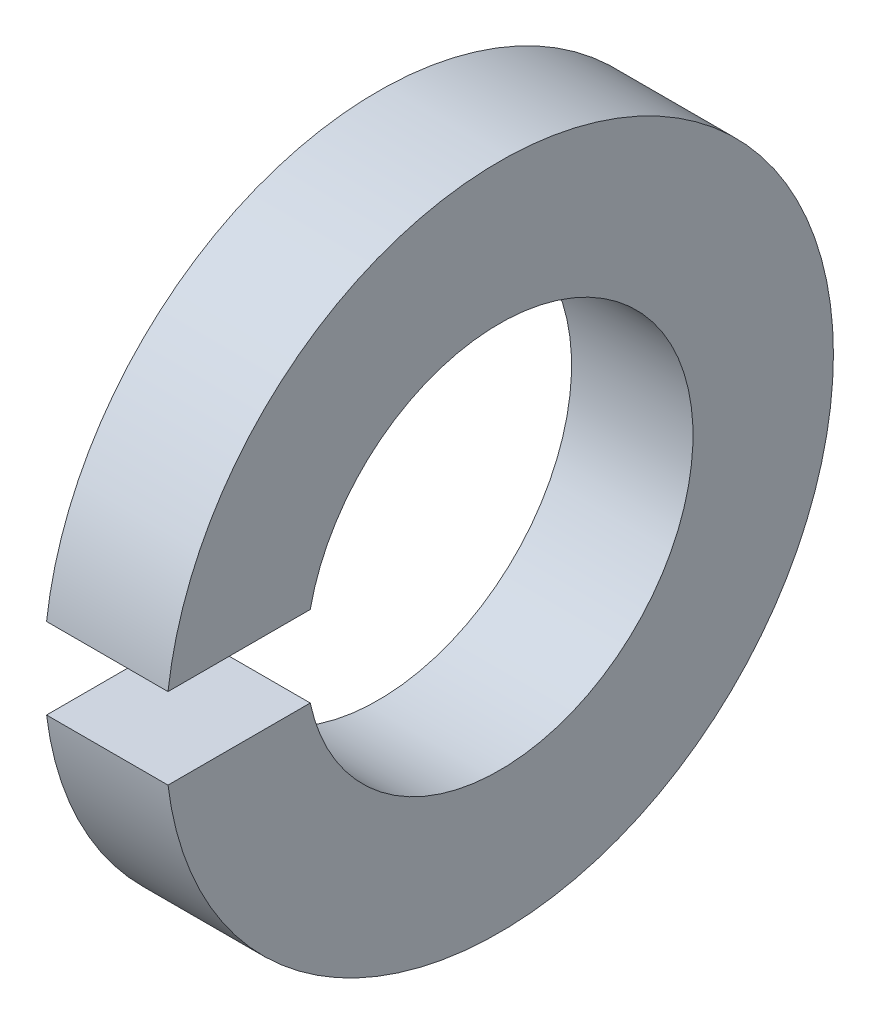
ISO-10303-21;
HEADER;
FILE_DESCRIPTION(('STEP AP214'),'2;1');
FILE_NAME('part.step','',(''),(''),'','','');
FILE_SCHEMA(('AUTOMOTIVE_DESIGN { 1 0 10303 214 1 1 1 1 }'));
ENDSEC;
DATA;
#1=APPLICATION_CONTEXT('core data for automotive mechanical design processes');
#2=APPLICATION_PROTOCOL_DEFINITION('international standard','automotive_design',2000,#1);
#3=PRODUCT_CONTEXT('',#1,'mechanical');
#4=PRODUCT('Part','Part','',(#3));
#5=PRODUCT_RELATED_PRODUCT_CATEGORY('part','',(#4));
#6=PRODUCT_DEFINITION_FORMATION('','',#4);
#7=PRODUCT_DEFINITION_CONTEXT('part definition',#1,'design');
#8=PRODUCT_DEFINITION('design','',#6,#7);
#9=PRODUCT_DEFINITION_SHAPE('','',#8);
#10=(LENGTH_UNIT() NAMED_UNIT(*) SI_UNIT(.MILLI.,.METRE.));
#11=(NAMED_UNIT(*) PLANE_ANGLE_UNIT() SI_UNIT($,.RADIAN.));
#12=(NAMED_UNIT(*) SI_UNIT($,.STERADIAN.) SOLID_ANGLE_UNIT());
#13=UNCERTAINTY_MEASURE_WITH_UNIT(LENGTH_MEASURE(1.E-05),#10,'distance_accuracy_value','');
#14=(GEOMETRIC_REPRESENTATION_CONTEXT(3) GLOBAL_UNCERTAINTY_ASSIGNED_CONTEXT((#13)) GLOBAL_UNIT_ASSIGNED_CONTEXT((#10,
#11,#12)) REPRESENTATION_CONTEXT('',''));
#15=CARTESIAN_POINT('',(0.,0.,0.));
#16=DIRECTION('',(0.,0.,1.));
#17=DIRECTION('',(1.,0.,0.));
#18=AXIS2_PLACEMENT_3D('',#15,#16,#17);
#19=CARTESIAN_POINT('',(-53.5,-15.5,45.5000000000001));
#20=DIRECTION('',(-1.,0.,0.));
#21=DIRECTION('',(0.,0.,1.));
#22=AXIS2_PLACEMENT_3D('',#19,#20,#21);
#23=CYLINDRICAL_SURFACE('',#22,4.4);
#24=CARTESIAN_POINT('',(-54.3,-15.5,45.5000000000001));
#25=DIRECTION('',(1.,0.,0.));
#26=DIRECTION('',(0.,1.,0.));
#27=AXIS2_PLACEMENT_3D('',#24,#25,#26);
#28=CIRCLE('',#27,4.4);
#29=CARTESIAN_POINT('',(-54.3,-16.0333333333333,49.8675571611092));
#30=VERTEX_POINT('',#29);
#31=CARTESIAN_POINT('',(-54.3,-14.9666666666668,49.8675571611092));
#32=VERTEX_POINT('',#31);
#33=EDGE_CURVE('E9',#30,#32,#28,.T.);
#34=ORIENTED_EDGE('',*,*,#33,.T.);
#35=DIRECTION('',(1.,0.,0.));
#36=VECTOR('',#35,1.);
#37=CARTESIAN_POINT('',(-53.5,-14.9666666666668,49.8675571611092));
#38=LINE('',#37,#36);
#39=CARTESIAN_POINT('',(-52.7,-14.9666666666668,49.8675571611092));
#40=VERTEX_POINT('',#39);
#41=EDGE_CURVE('E72',#32,#40,#38,.T.);
#42=ORIENTED_EDGE('',*,*,#41,.T.);
#43=CARTESIAN_POINT('',(-52.7,-15.5,45.5000000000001));
#44=DIRECTION('',(1.,0.,0.));
#45=DIRECTION('',(0.,1.,0.));
#46=AXIS2_PLACEMENT_3D('',#43,#44,#45);
#47=CIRCLE('',#46,4.4);
#48=CARTESIAN_POINT('',(-52.7,-16.0333333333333,49.8675571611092));
#49=VERTEX_POINT('',#48);
#50=EDGE_CURVE('E60',#49,#40,#47,.T.);
#51=ORIENTED_EDGE('',*,*,#50,.F.);
#52=DIRECTION('',(-1.,0.,0.));
#53=VECTOR('',#52,1.);
#54=CARTESIAN_POINT('',(-53.5,-16.0333333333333,49.8675571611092));
#55=LINE('',#54,#53);
#56=EDGE_CURVE('E18',#49,#30,#55,.T.);
#57=ORIENTED_EDGE('',*,*,#56,.T.);
#58=EDGE_LOOP('',(#34,#42,#51,#57));
#59=FACE_BOUND('',#58,.T.);
#60=ADVANCED_FACE('F14',(#59),#23,.T.);
#61=CARTESIAN_POINT('',(-54.3,-12.025,45.5000000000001));
#62=DIRECTION('',(-1.,0.,0.));
#63=DIRECTION('',(0.,0.,1.));
#64=AXIS2_PLACEMENT_3D('',#61,#62,#63);
#65=PLANE('',#64);
#66=DIRECTION('',(0.,0.,1.));
#67=VECTOR('',#66,1.);
#68=CARTESIAN_POINT('',(-54.3,-14.9666666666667,45.5000000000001));
#69=LINE('',#68,#67);
#70=CARTESIAN_POINT('',(-54.3,-14.9666666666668,47.9936029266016));
#71=VERTEX_POINT('',#70);
#72=EDGE_CURVE('E25',#71,#32,#69,.T.);
#73=ORIENTED_EDGE('',*,*,#72,.T.);
#74=ORIENTED_EDGE('',*,*,#33,.F.);
#75=DIRECTION('',(0.,0.,-1.));
#76=VECTOR('',#75,1.);
#77=CARTESIAN_POINT('',(-54.3,-16.0333333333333,45.5000000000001));
#78=LINE('',#77,#76);
#79=CARTESIAN_POINT('',(-54.3,-16.0333333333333,47.9936029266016));
#80=VERTEX_POINT('',#79);
#81=EDGE_CURVE('E83',#30,#80,#78,.T.);
#82=ORIENTED_EDGE('',*,*,#81,.T.);
#83=CARTESIAN_POINT('',(-54.3,-15.5,45.5000000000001));
#84=DIRECTION('',(1.,0.,0.));
#85=DIRECTION('',(0.,1.,0.));
#86=AXIS2_PLACEMENT_3D('',#83,#84,#85);
#87=CIRCLE('',#86,2.55);
#88=EDGE_CURVE('E45',#80,#71,#87,.T.);
#89=ORIENTED_EDGE('',*,*,#88,.T.);
#90=EDGE_LOOP('',(#73,#74,#82,#89));
#91=FACE_BOUND('',#90,.T.);
#92=ADVANCED_FACE('F94',(#91),#65,.T.);
#93=CARTESIAN_POINT('',(-52.7,-12.025,45.5000000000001));
#94=DIRECTION('',(1.,0.,0.));
#95=DIRECTION('',(0.,0.,-1.));
#96=AXIS2_PLACEMENT_3D('',#93,#94,#95);
#97=PLANE('',#96);
#98=DIRECTION('',(0.,0.,-1.));
#99=VECTOR('',#98,1.);
#100=CARTESIAN_POINT('',(-52.7,-14.9666666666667,45.5000000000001));
#101=LINE('',#100,#99);
#102=CARTESIAN_POINT('',(-52.7,-14.9666666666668,47.9936029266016));
#103=VERTEX_POINT('',#102);
#104=EDGE_CURVE('E65',#40,#103,#101,.T.);
#105=ORIENTED_EDGE('',*,*,#104,.T.);
#106=CARTESIAN_POINT('',(-52.7,-15.5,45.5000000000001));
#107=DIRECTION('',(1.,0.,0.));
#108=DIRECTION('',(0.,1.,0.));
#109=AXIS2_PLACEMENT_3D('',#106,#107,#108);
#110=CIRCLE('',#109,2.55);
#111=CARTESIAN_POINT('',(-52.7,-16.0333333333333,47.9936029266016));
#112=VERTEX_POINT('',#111);
#113=EDGE_CURVE('E70',#112,#103,#110,.T.);
#114=ORIENTED_EDGE('',*,*,#113,.F.);
#115=DIRECTION('',(0.,0.,1.));
#116=VECTOR('',#115,1.);
#117=CARTESIAN_POINT('',(-52.7,-16.0333333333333,45.5000000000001));
#118=LINE('',#117,#116);
#119=EDGE_CURVE('E67',#112,#49,#118,.T.);
#120=ORIENTED_EDGE('',*,*,#119,.T.);
#121=ORIENTED_EDGE('',*,*,#50,.T.);
#122=EDGE_LOOP('',(#105,#114,#120,#121));
#123=FACE_BOUND('',#122,.T.);
#124=ADVANCED_FACE('F64',(#123),#97,.T.);
#125=CARTESIAN_POINT('',(-53.5,-15.5,45.5000000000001));
#126=DIRECTION('',(-1.,0.,0.));
#127=DIRECTION('',(0.,0.,1.));
#128=AXIS2_PLACEMENT_3D('',#125,#126,#127);
#129=CYLINDRICAL_SURFACE('',#128,2.55);
#130=DIRECTION('',(-1.,0.,0.));
#131=VECTOR('',#130,1.);
#132=CARTESIAN_POINT('',(-53.5,-14.9666666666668,47.9936029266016));
#133=LINE('',#132,#131);
#134=EDGE_CURVE('E53',#103,#71,#133,.T.);
#135=ORIENTED_EDGE('',*,*,#134,.T.);
#136=ORIENTED_EDGE('',*,*,#88,.F.);
#137=DIRECTION('',(1.,0.,0.));
#138=VECTOR('',#137,1.);
#139=CARTESIAN_POINT('',(-53.5,-16.0333333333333,47.9936029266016));
#140=LINE('',#139,#138);
#141=EDGE_CURVE('E74',#80,#112,#140,.T.);
#142=ORIENTED_EDGE('',*,*,#141,.T.);
#143=ORIENTED_EDGE('',*,*,#113,.T.);
#144=EDGE_LOOP('',(#135,#136,#142,#143));
#145=FACE_BOUND('',#144,.T.);
#146=ADVANCED_FACE('F16',(#145),#129,.F.);
#147=CARTESIAN_POINT('',(-52.7,-16.0333333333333,45.5000000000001));
#148=DIRECTION('',(0.,1.,0.));
#149=DIRECTION('',(0.,0.,1.));
#150=AXIS2_PLACEMENT_3D('',#147,#148,#149);
#151=PLANE('',#150);
#152=ORIENTED_EDGE('',*,*,#141,.F.);
#153=ORIENTED_EDGE('',*,*,#81,.F.);
#154=ORIENTED_EDGE('',*,*,#56,.F.);
#155=ORIENTED_EDGE('',*,*,#119,.F.);
#156=EDGE_LOOP('',(#152,#153,#154,#155));
#157=FACE_BOUND('',#156,.T.);
#158=ADVANCED_FACE('F98',(#157),#151,.T.);
#159=CARTESIAN_POINT('',(-54.3,-14.9666666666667,45.5000000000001));
#160=DIRECTION('',(0.,-1.,0.));
#161=DIRECTION('',(0.,0.,-1.));
#162=AXIS2_PLACEMENT_3D('',#159,#160,#161);
#163=PLANE('',#162);
#164=ORIENTED_EDGE('',*,*,#41,.F.);
#165=ORIENTED_EDGE('',*,*,#72,.F.);
#166=ORIENTED_EDGE('',*,*,#134,.F.);
#167=ORIENTED_EDGE('',*,*,#104,.F.);
#168=EDGE_LOOP('',(#164,#165,#166,#167));
#169=FACE_BOUND('',#168,.T.);
#170=ADVANCED_FACE('F76',(#169),#163,.T.);
#171=CLOSED_SHELL('',(#60,#92,#124,#146,#158,#170));
#172=MANIFOLD_SOLID_BREP('B1',#171);
#173=ADVANCED_BREP_SHAPE_REPRESENTATION('',(#18,#172),#14);
#174=SHAPE_DEFINITION_REPRESENTATION(#9,#173);
ENDSEC;
END-ISO-10303-21;
